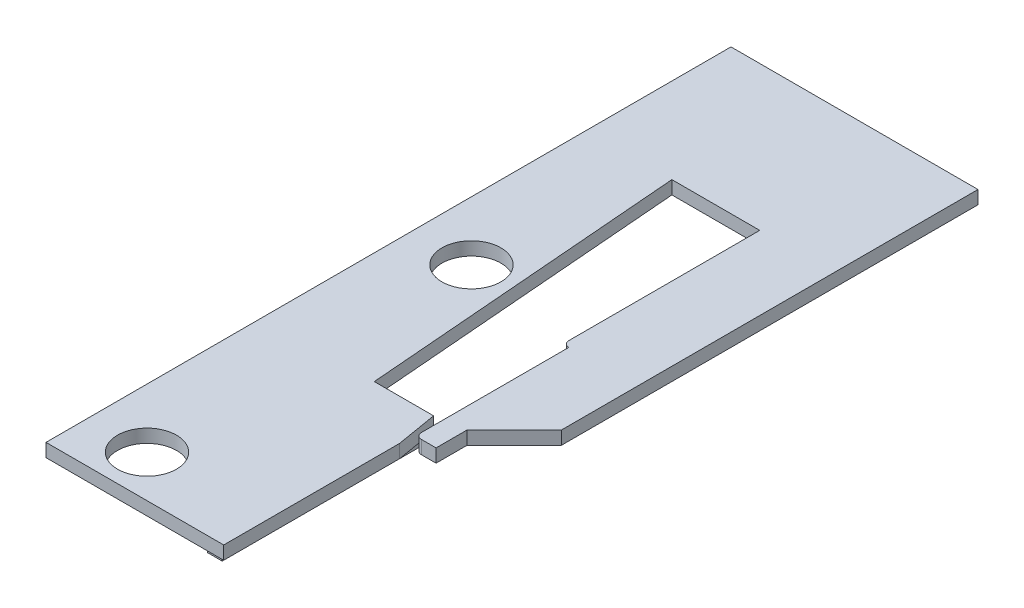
ISO-10303-21;
HEADER;
FILE_DESCRIPTION(('STEP AP214'),'2;1');
FILE_NAME('part.step','',(''),(''),'','','');
FILE_SCHEMA(('AUTOMOTIVE_DESIGN { 1 0 10303 214 1 1 1 1 }'));
ENDSEC;
DATA;
#1=APPLICATION_CONTEXT('core data for automotive mechanical design processes');
#2=APPLICATION_PROTOCOL_DEFINITION('international standard','automotive_design',2000,#1);
#3=PRODUCT_CONTEXT('',#1,'mechanical');
#4=PRODUCT('Part','Part','',(#3));
#5=PRODUCT_RELATED_PRODUCT_CATEGORY('part','',(#4));
#6=PRODUCT_DEFINITION_FORMATION('','',#4);
#7=PRODUCT_DEFINITION_CONTEXT('part definition',#1,'design');
#8=PRODUCT_DEFINITION('design','',#6,#7);
#9=PRODUCT_DEFINITION_SHAPE('','',#8);
#10=(LENGTH_UNIT() NAMED_UNIT(*) SI_UNIT(.MILLI.,.METRE.));
#11=(NAMED_UNIT(*) PLANE_ANGLE_UNIT() SI_UNIT($,.RADIAN.));
#12=(NAMED_UNIT(*) SI_UNIT($,.STERADIAN.) SOLID_ANGLE_UNIT());
#13=UNCERTAINTY_MEASURE_WITH_UNIT(LENGTH_MEASURE(1.E-05),#10,'distance_accuracy_value','');
#14=(GEOMETRIC_REPRESENTATION_CONTEXT(3) GLOBAL_UNCERTAINTY_ASSIGNED_CONTEXT((#13)) GLOBAL_UNIT_ASSIGNED_CONTEXT((#10,
#11,#12)) REPRESENTATION_CONTEXT('',''));
#15=CARTESIAN_POINT('',(0.,0.,0.));
#16=DIRECTION('',(0.,0.,1.));
#17=DIRECTION('',(1.,0.,0.));
#18=AXIS2_PLACEMENT_3D('',#15,#16,#17);
#19=CARTESIAN_POINT('',(42.25,0.9,0.));
#20=DIRECTION('',(1.,0.,0.));
#21=DIRECTION('',(0.,0.,-1.));
#22=AXIS2_PLACEMENT_3D('',#19,#20,#21);
#23=PLANE('',#22);
#24=DIRECTION('',(0.,-1.,0.));
#25=VECTOR('',#24,1.);
#26=CARTESIAN_POINT('',(42.25,0.9,-9.5));
#27=LINE('',#26,#25);
#28=CARTESIAN_POINT('',(42.25,0.9,-9.5));
#29=VERTEX_POINT('',#28);
#30=CARTESIAN_POINT('',(42.25,0.,-9.5));
#31=VERTEX_POINT('',#30);
#32=EDGE_CURVE('E276',#29,#31,#27,.T.);
#33=ORIENTED_EDGE('',*,*,#32,.T.);
#34=DIRECTION('',(0.,0.,1.));
#35=VECTOR('',#34,1.);
#36=CARTESIAN_POINT('',(42.25,0.,-13.5000000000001));
#37=LINE('',#36,#35);
#38=CARTESIAN_POINT('',(42.25,0.,-13.5000000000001));
#39=VERTEX_POINT('',#38);
#40=EDGE_CURVE('E253',#39,#31,#37,.T.);
#41=ORIENTED_EDGE('',*,*,#40,.F.);
#42=DIRECTION('',(0.,1.,0.));
#43=VECTOR('',#42,1.);
#44=CARTESIAN_POINT('',(42.25,-0.4,-13.5000000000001));
#45=LINE('',#44,#43);
#46=CARTESIAN_POINT('',(42.25,-0.4,-13.5000000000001));
#47=VERTEX_POINT('',#46);
#48=EDGE_CURVE('E261',#47,#39,#45,.T.);
#49=ORIENTED_EDGE('',*,*,#48,.F.);
#50=DIRECTION('',(0.,0.,1.));
#51=VECTOR('',#50,1.);
#52=CARTESIAN_POINT('',(42.25,-0.4,-13.5000000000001));
#53=LINE('',#52,#51);
#54=CARTESIAN_POINT('',(42.25,-0.4,0.499999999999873));
#55=VERTEX_POINT('',#54);
#56=EDGE_CURVE('E242',#47,#55,#53,.T.);
#57=ORIENTED_EDGE('',*,*,#56,.T.);
#58=DIRECTION('',(0.,1.,0.));
#59=VECTOR('',#58,1.);
#60=CARTESIAN_POINT('',(42.25,-0.4,0.499999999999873));
#61=LINE('',#60,#59);
#62=CARTESIAN_POINT('',(42.25,0.,0.499999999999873));
#63=VERTEX_POINT('',#62);
#64=EDGE_CURVE('E259',#55,#63,#61,.T.);
#65=ORIENTED_EDGE('',*,*,#64,.T.);
#66=DIRECTION('',(0.,-1.,0.));
#67=VECTOR('',#66,1.);
#68=CARTESIAN_POINT('',(42.25,0.9,0.500000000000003));
#69=LINE('',#68,#67);
#70=CARTESIAN_POINT('',(42.25,0.9,0.500000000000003));
#71=VERTEX_POINT('',#70);
#72=EDGE_CURVE('E11',#71,#63,#69,.T.);
#73=ORIENTED_EDGE('',*,*,#72,.F.);
#74=DIRECTION('',(0.,0.,1.));
#75=VECTOR('',#74,1.);
#76=CARTESIAN_POINT('',(42.25,0.9,0.));
#77=LINE('',#76,#75);
#78=EDGE_CURVE('E434',#29,#71,#77,.T.);
#79=ORIENTED_EDGE('',*,*,#78,.F.);
#80=EDGE_LOOP('',(#33,#41,#49,#57,#65,#73,#79));
#81=FACE_BOUND('',#80,.T.);
#82=ADVANCED_FACE('F35',(#81),#23,.F.);
#83=CARTESIAN_POINT('',(42.65,0.9,0.5));
#84=DIRECTION('',(0.,-1.,0.));
#85=DIRECTION('',(0.,0.,-1.));
#86=AXIS2_PLACEMENT_3D('',#83,#84,#85);
#87=CYLINDRICAL_SURFACE('',#86,0.399999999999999);
#88=CARTESIAN_POINT('',(42.65,0.,0.5));
#89=DIRECTION('',(0.,1.,0.));
#90=DIRECTION('',(0.,0.,1.));
#91=AXIS2_PLACEMENT_3D('',#88,#89,#90);
#92=CIRCLE('',#91,0.399999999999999);
#93=CARTESIAN_POINT('',(42.65,0.,0.9));
#94=VERTEX_POINT('',#93);
#95=EDGE_CURVE('E302',#63,#94,#92,.T.);
#96=ORIENTED_EDGE('',*,*,#95,.T.);
#97=DIRECTION('',(0.,-1.,0.));
#98=VECTOR('',#97,1.);
#99=CARTESIAN_POINT('',(42.65,0.9,0.9));
#100=LINE('',#99,#98);
#101=CARTESIAN_POINT('',(42.65,0.9,0.9));
#102=VERTEX_POINT('',#101);
#103=EDGE_CURVE('E44',#102,#94,#100,.T.);
#104=ORIENTED_EDGE('',*,*,#103,.F.);
#105=CARTESIAN_POINT('',(42.65,0.9,0.5));
#106=DIRECTION('',(0.,1.,0.));
#107=DIRECTION('',(0.,0.,1.));
#108=AXIS2_PLACEMENT_3D('',#105,#106,#107);
#109=CIRCLE('',#108,0.399999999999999);
#110=EDGE_CURVE('E393',#71,#102,#109,.T.);
#111=ORIENTED_EDGE('',*,*,#110,.F.);
#112=ORIENTED_EDGE('',*,*,#72,.T.);
#113=EDGE_LOOP('',(#96,#104,#111,#112));
#114=FACE_BOUND('',#113,.T.);
#115=ADVANCED_FACE('F457',(#114),#87,.T.);
#116=CARTESIAN_POINT('',(0.,0.9,0.900000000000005));
#117=DIRECTION('',(0.,0.,-1.));
#118=DIRECTION('',(-1.,0.,0.));
#119=AXIS2_PLACEMENT_3D('',#116,#117,#118);
#120=PLANE('',#119);
#121=DIRECTION('',(1.,0.,0.));
#122=VECTOR('',#121,1.);
#123=CARTESIAN_POINT('',(0.,0.,0.900000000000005));
#124=LINE('',#123,#122);
#125=CARTESIAN_POINT('',(43.65,0.,0.9));
#126=VERTEX_POINT('',#125);
#127=EDGE_CURVE('E304',#94,#126,#124,.T.);
#128=ORIENTED_EDGE('',*,*,#127,.T.);
#129=DIRECTION('',(0.,-1.,0.));
#130=VECTOR('',#129,1.);
#131=CARTESIAN_POINT('',(43.65,0.9,0.9));
#132=LINE('',#131,#130);
#133=CARTESIAN_POINT('',(43.65,0.9,0.9));
#134=VERTEX_POINT('',#133);
#135=EDGE_CURVE('E365',#134,#126,#132,.T.);
#136=ORIENTED_EDGE('',*,*,#135,.F.);
#137=DIRECTION('',(1.,0.,0.));
#138=VECTOR('',#137,1.);
#139=CARTESIAN_POINT('',(0.,0.9,0.900000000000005));
#140=LINE('',#139,#138);
#141=EDGE_CURVE('E373',#102,#134,#140,.T.);
#142=ORIENTED_EDGE('',*,*,#141,.F.);
#143=ORIENTED_EDGE('',*,*,#103,.T.);
#144=EDGE_LOOP('',(#128,#136,#142,#143));
#145=FACE_BOUND('',#144,.T.);
#146=ADVANCED_FACE('F371',(#145),#120,.F.);
#147=CARTESIAN_POINT('',(43.65,0.9,0.));
#148=DIRECTION('',(1.,0.,0.));
#149=DIRECTION('',(0.,0.,-1.));
#150=AXIS2_PLACEMENT_3D('',#147,#148,#149);
#151=PLANE('',#150);
#152=DIRECTION('',(0.,0.,1.));
#153=VECTOR('',#152,1.);
#154=CARTESIAN_POINT('',(43.65,0.,0.));
#155=LINE('',#154,#153);
#156=CARTESIAN_POINT('',(43.65,0.,-1.20000000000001));
#157=VERTEX_POINT('',#156);
#158=EDGE_CURVE('E307',#157,#126,#155,.T.);
#159=ORIENTED_EDGE('',*,*,#158,.F.);
#160=DIRECTION('',(0.,-1.,0.));
#161=VECTOR('',#160,1.);
#162=CARTESIAN_POINT('',(43.65,0.9,-1.20000000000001));
#163=LINE('',#162,#161);
#164=CARTESIAN_POINT('',(43.65,0.9,-1.20000000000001));
#165=VERTEX_POINT('',#164);
#166=EDGE_CURVE('E363',#165,#157,#163,.T.);
#167=ORIENTED_EDGE('',*,*,#166,.F.);
#168=DIRECTION('',(0.,0.,1.));
#169=VECTOR('',#168,1.);
#170=CARTESIAN_POINT('',(43.65,0.9,0.));
#171=LINE('',#170,#169);
#172=EDGE_CURVE('E386',#165,#134,#171,.T.);
#173=ORIENTED_EDGE('',*,*,#172,.T.);
#174=ORIENTED_EDGE('',*,*,#135,.T.);
#175=EDGE_LOOP('',(#159,#167,#173,#174));
#176=FACE_BOUND('',#175,.T.);
#177=ADVANCED_FACE('F383',(#176),#151,.T.);
#178=CARTESIAN_POINT('',(21.225,0.9,21.225));
#179=DIRECTION('',(0.707106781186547,0.,0.707106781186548));
#180=DIRECTION('',(0.707106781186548,0.,-0.707106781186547));
#181=AXIS2_PLACEMENT_3D('',#178,#179,#180);
#182=PLANE('',#181);
#183=DIRECTION('',(-0.707106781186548,0.,0.707106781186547));
#184=VECTOR('',#183,1.);
#185=CARTESIAN_POINT('',(21.225,0.,21.225));
#186=LINE('',#185,#184);
#187=CARTESIAN_POINT('',(46.85,0.,-4.40000000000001));
#188=VERTEX_POINT('',#187);
#189=EDGE_CURVE('E310',#188,#157,#186,.T.);
#190=ORIENTED_EDGE('',*,*,#189,.F.);
#191=DIRECTION('',(0.,-1.,0.));
#192=VECTOR('',#191,1.);
#193=CARTESIAN_POINT('',(46.85,0.9,-4.40000000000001));
#194=LINE('',#193,#192);
#195=CARTESIAN_POINT('',(46.85,0.9,-4.40000000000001));
#196=VERTEX_POINT('',#195);
#197=EDGE_CURVE('E361',#196,#188,#194,.T.);
#198=ORIENTED_EDGE('',*,*,#197,.F.);
#199=DIRECTION('',(-0.707106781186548,0.,0.707106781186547));
#200=VECTOR('',#199,1.);
#201=CARTESIAN_POINT('',(21.225,0.9,21.225));
#202=LINE('',#201,#200);
#203=EDGE_CURVE('E389',#196,#165,#202,.T.);
#204=ORIENTED_EDGE('',*,*,#203,.T.);
#205=ORIENTED_EDGE('',*,*,#166,.T.);
#206=EDGE_LOOP('',(#190,#198,#204,#205));
#207=FACE_BOUND('',#206,.T.);
#208=ADVANCED_FACE('F510',(#207),#182,.T.);
#209=CARTESIAN_POINT('',(46.85,0.9,0.));
#210=DIRECTION('',(-1.,0.,0.));
#211=DIRECTION('',(0.,0.,1.));
#212=AXIS2_PLACEMENT_3D('',#209,#210,#211);
#213=PLANE('',#212);
#214=DIRECTION('',(0.,0.,-1.));
#215=VECTOR('',#214,1.);
#216=CARTESIAN_POINT('',(46.85,0.,0.));
#217=LINE('',#216,#215);
#218=CARTESIAN_POINT('',(46.85,0.,-32.65));
#219=VERTEX_POINT('',#218);
#220=EDGE_CURVE('E313',#188,#219,#217,.T.);
#221=ORIENTED_EDGE('',*,*,#220,.T.);
#222=DIRECTION('',(0.,-1.,0.));
#223=VECTOR('',#222,1.);
#224=CARTESIAN_POINT('',(46.85,0.9,-32.65));
#225=LINE('',#224,#223);
#226=CARTESIAN_POINT('',(46.85,0.9,-32.65));
#227=VERTEX_POINT('',#226);
#228=EDGE_CURVE('E359',#227,#219,#225,.T.);
#229=ORIENTED_EDGE('',*,*,#228,.F.);
#230=DIRECTION('',(0.,0.,-1.));
#231=VECTOR('',#230,1.);
#232=CARTESIAN_POINT('',(46.85,0.9,0.));
#233=LINE('',#232,#231);
#234=EDGE_CURVE('E391',#196,#227,#233,.T.);
#235=ORIENTED_EDGE('',*,*,#234,.F.);
#236=ORIENTED_EDGE('',*,*,#197,.T.);
#237=EDGE_LOOP('',(#221,#229,#235,#236));
#238=FACE_BOUND('',#237,.T.);
#239=ADVANCED_FACE('F506',(#238),#213,.F.);
#240=CARTESIAN_POINT('',(0.,0.9,-32.65));
#241=DIRECTION('',(0.,0.,-1.));
#242=DIRECTION('',(-1.,0.,0.));
#243=AXIS2_PLACEMENT_3D('',#240,#241,#242);
#244=PLANE('',#243);
#245=DIRECTION('',(1.,0.,0.));
#246=VECTOR('',#245,1.);
#247=CARTESIAN_POINT('',(0.,0.,-32.65));
#248=LINE('',#247,#246);
#249=CARTESIAN_POINT('',(30.1,0.,-32.65));
#250=VERTEX_POINT('',#249);
#251=EDGE_CURVE('E316',#250,#219,#248,.T.);
#252=ORIENTED_EDGE('',*,*,#251,.F.);
#253=DIRECTION('',(0.,-1.,0.));
#254=VECTOR('',#253,1.);
#255=CARTESIAN_POINT('',(30.1,0.9,-32.65));
#256=LINE('',#255,#254);
#257=CARTESIAN_POINT('',(30.1,0.9,-32.65));
#258=VERTEX_POINT('',#257);
#259=EDGE_CURVE('E357',#258,#250,#256,.T.);
#260=ORIENTED_EDGE('',*,*,#259,.F.);
#261=DIRECTION('',(1.,0.,0.));
#262=VECTOR('',#261,1.);
#263=CARTESIAN_POINT('',(0.,0.9,-32.65));
#264=LINE('',#263,#262);
#265=EDGE_CURVE('E398',#258,#227,#264,.T.);
#266=ORIENTED_EDGE('',*,*,#265,.T.);
#267=ORIENTED_EDGE('',*,*,#228,.T.);
#268=EDGE_LOOP('',(#252,#260,#266,#267));
#269=FACE_BOUND('',#268,.T.);
#270=ADVANCED_FACE('F502',(#269),#244,.T.);
#271=CARTESIAN_POINT('',(30.1,0.9,0.));
#272=DIRECTION('',(-1.,0.,0.));
#273=DIRECTION('',(0.,0.,1.));
#274=AXIS2_PLACEMENT_3D('',#271,#272,#273);
#275=PLANE('',#274);
#276=DIRECTION('',(0.,0.,-1.));
#277=VECTOR('',#276,1.);
#278=CARTESIAN_POINT('',(30.1,0.,0.));
#279=LINE('',#278,#277);
#280=CARTESIAN_POINT('',(30.1,0.,13.8));
#281=VERTEX_POINT('',#280);
#282=EDGE_CURVE('E319',#281,#250,#279,.T.);
#283=ORIENTED_EDGE('',*,*,#282,.F.);
#284=DIRECTION('',(0.,-1.,0.));
#285=VECTOR('',#284,1.);
#286=CARTESIAN_POINT('',(30.1,0.9,13.8));
#287=LINE('',#286,#285);
#288=CARTESIAN_POINT('',(30.1,0.9,13.8));
#289=VERTEX_POINT('',#288);
#290=EDGE_CURVE('E355',#289,#281,#287,.T.);
#291=ORIENTED_EDGE('',*,*,#290,.F.);
#292=DIRECTION('',(0.,0.,-1.));
#293=VECTOR('',#292,1.);
#294=CARTESIAN_POINT('',(30.1,0.9,0.));
#295=LINE('',#294,#293);
#296=EDGE_CURVE('E401',#289,#258,#295,.T.);
#297=ORIENTED_EDGE('',*,*,#296,.T.);
#298=ORIENTED_EDGE('',*,*,#259,.T.);
#299=EDGE_LOOP('',(#283,#291,#297,#298));
#300=FACE_BOUND('',#299,.T.);
#301=ADVANCED_FACE('F498',(#300),#275,.T.);
#302=CARTESIAN_POINT('',(0.,0.9,13.8));
#303=DIRECTION('',(0.,0.,1.));
#304=DIRECTION('',(1.,0.,0.));
#305=AXIS2_PLACEMENT_3D('',#302,#303,#304);
#306=PLANE('',#305);
#307=DIRECTION('',(-1.,0.,0.));
#308=VECTOR('',#307,1.);
#309=CARTESIAN_POINT('',(0.,0.,13.8));
#310=LINE('',#309,#308);
#311=CARTESIAN_POINT('',(42.15,0.,13.8));
#312=VERTEX_POINT('',#311);
#313=EDGE_CURVE('E322',#312,#281,#310,.T.);
#314=ORIENTED_EDGE('',*,*,#313,.F.);
#315=DIRECTION('',(0.,-1.,0.));
#316=VECTOR('',#315,1.);
#317=CARTESIAN_POINT('',(42.15,0.9,13.8));
#318=LINE('',#317,#316);
#319=CARTESIAN_POINT('',(42.15,0.9,13.8));
#320=VERTEX_POINT('',#319);
#321=EDGE_CURVE('E353',#320,#312,#318,.T.);
#322=ORIENTED_EDGE('',*,*,#321,.F.);
#323=DIRECTION('',(-1.,0.,0.));
#324=VECTOR('',#323,1.);
#325=CARTESIAN_POINT('',(0.,0.9,13.8));
#326=LINE('',#325,#324);
#327=EDGE_CURVE('E404',#320,#289,#326,.T.);
#328=ORIENTED_EDGE('',*,*,#327,.T.);
#329=ORIENTED_EDGE('',*,*,#290,.T.);
#330=EDGE_LOOP('',(#314,#322,#328,#329));
#331=FACE_BOUND('',#330,.T.);
#332=ADVANCED_FACE('F494',(#331),#306,.T.);
#333=CARTESIAN_POINT('',(42.15,0.9,0.));
#334=DIRECTION('',(1.,0.,0.));
#335=DIRECTION('',(0.,0.,-1.));
#336=AXIS2_PLACEMENT_3D('',#333,#334,#335);
#337=PLANE('',#336);
#338=DIRECTION('',(0.,0.,1.));
#339=VECTOR('',#338,1.);
#340=CARTESIAN_POINT('',(42.15,0.,0.));
#341=LINE('',#340,#339);
#342=CARTESIAN_POINT('',(42.15,0.,1.8733333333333));
#343=VERTEX_POINT('',#342);
#344=EDGE_CURVE('E325',#343,#312,#341,.T.);
#345=ORIENTED_EDGE('',*,*,#344,.F.);
#346=DIRECTION('',(0.,-1.,0.));
#347=VECTOR('',#346,1.);
#348=CARTESIAN_POINT('',(42.15,0.9,1.8733333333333));
#349=LINE('',#348,#347);
#350=CARTESIAN_POINT('',(42.15,0.9,1.8733333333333));
#351=VERTEX_POINT('',#350);
#352=EDGE_CURVE('E350',#351,#343,#349,.T.);
#353=ORIENTED_EDGE('',*,*,#352,.F.);
#354=DIRECTION('',(0.,0.,1.));
#355=VECTOR('',#354,1.);
#356=CARTESIAN_POINT('',(42.15,0.9,0.));
#357=LINE('',#356,#355);
#358=EDGE_CURVE('E407',#351,#320,#357,.T.);
#359=ORIENTED_EDGE('',*,*,#358,.T.);
#360=ORIENTED_EDGE('',*,*,#321,.T.);
#361=EDGE_LOOP('',(#345,#353,#359,#360));
#362=FACE_BOUND('',#361,.T.);
#363=ADVANCED_FACE('F490',(#362),#337,.T.);
#364=CARTESIAN_POINT('',(40.6787687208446,0.9,-6.85597225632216));
#365=DIRECTION('',(0.986092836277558,0.,-0.166195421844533));
#366=DIRECTION('',(-0.166195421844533,0.,-0.986092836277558));
#367=AXIS2_PLACEMENT_3D('',#364,#365,#366);
#368=PLANE('',#367);
#369=DIRECTION('',(0.166195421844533,0.,0.986092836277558));
#370=VECTOR('',#369,1.);
#371=CARTESIAN_POINT('',(40.6787687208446,0.,-6.85597225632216));
#372=LINE('',#371,#370);
#373=CARTESIAN_POINT('',(41.6825842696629,0.,-0.900000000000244));
#374=VERTEX_POINT('',#373);
#375=CARTESIAN_POINT('',(41.75,0.,-0.500000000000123));
#376=VERTEX_POINT('',#375);
#377=EDGE_CURVE('E329',#374,#376,#372,.T.);
#378=ORIENTED_EDGE('',*,*,#377,.F.);
#379=DIRECTION('',(0.,-1.,0.));
#380=VECTOR('',#379,1.);
#381=CARTESIAN_POINT('',(41.6825842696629,0.9,-0.900000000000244));
#382=LINE('',#381,#380);
#383=CARTESIAN_POINT('',(41.6825842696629,0.9,-0.900000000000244));
#384=VERTEX_POINT('',#383);
#385=EDGE_CURVE('E348',#384,#374,#382,.T.);
#386=ORIENTED_EDGE('',*,*,#385,.F.);
#387=DIRECTION('',(0.166195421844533,0.,0.986092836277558));
#388=VECTOR('',#387,1.);
#389=CARTESIAN_POINT('',(40.6787687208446,0.9,-6.85597225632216));
#390=LINE('',#389,#388);
#391=EDGE_CURVE('E410',#384,#351,#390,.T.);
#392=ORIENTED_EDGE('',*,*,#391,.T.);
#393=ORIENTED_EDGE('',*,*,#352,.T.);
#394=EDGE_CURVE('E328',#376,#343,#372,.T.);
#395=ORIENTED_EDGE('',*,*,#394,.F.);
#396=EDGE_LOOP('',(#378,#386,#392,#393,#395));
#397=FACE_BOUND('',#396,.T.);
#398=ADVANCED_FACE('F486',(#397),#368,.T.);
#399=CARTESIAN_POINT('',(0.,0.9,-0.900000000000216));
#400=DIRECTION('',(0.,0.,-1.));
#401=DIRECTION('',(-1.,0.,0.));
#402=AXIS2_PLACEMENT_3D('',#399,#400,#401);
#403=PLANE('',#402);
#404=DIRECTION('',(1.,0.,0.));
#405=VECTOR('',#404,1.);
#406=CARTESIAN_POINT('',(0.,0.,-0.900000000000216));
#407=LINE('',#406,#405);
#408=CARTESIAN_POINT('',(37.6614908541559,0.,-0.900000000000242));
#409=VERTEX_POINT('',#408);
#410=EDGE_CURVE('E332',#409,#374,#407,.T.);
#411=ORIENTED_EDGE('',*,*,#410,.F.);
#412=DIRECTION('',(0.,-1.,0.));
#413=VECTOR('',#412,1.);
#414=CARTESIAN_POINT('',(37.6614908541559,0.9,-0.900000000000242));
#415=LINE('',#414,#413);
#416=CARTESIAN_POINT('',(37.6614908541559,0.9,-0.900000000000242));
#417=VERTEX_POINT('',#416);
#418=EDGE_CURVE('E346',#417,#409,#415,.T.);
#419=ORIENTED_EDGE('',*,*,#418,.F.);
#420=DIRECTION('',(1.,0.,0.));
#421=VECTOR('',#420,1.);
#422=CARTESIAN_POINT('',(0.,0.9,-0.900000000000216));
#423=LINE('',#422,#421);
#424=EDGE_CURVE('E413',#417,#384,#423,.T.);
#425=ORIENTED_EDGE('',*,*,#424,.T.);
#426=ORIENTED_EDGE('',*,*,#385,.T.);
#427=EDGE_LOOP('',(#411,#419,#425,#426));
#428=FACE_BOUND('',#427,.T.);
#429=ADVANCED_FACE('F482',(#428),#403,.T.);
#430=CARTESIAN_POINT('',(37.4903141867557,0.9,-3.02292966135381));
#431=DIRECTION('',(0.996764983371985,0.,-0.080371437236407));
#432=DIRECTION('',(-0.080371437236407,0.,-0.996764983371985));
#433=AXIS2_PLACEMENT_3D('',#430,#431,#432);
#434=PLANE('',#433);
#435=DIRECTION('',(0.080371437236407,0.,0.996764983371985));
#436=VECTOR('',#435,1.);
#437=CARTESIAN_POINT('',(37.4903141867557,0.,-3.02292966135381));
#438=LINE('',#437,#436);
#439=CARTESIAN_POINT('',(35.8916122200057,0.,-22.85));
#440=VERTEX_POINT('',#439);
#441=EDGE_CURVE('E335',#440,#409,#438,.T.);
#442=ORIENTED_EDGE('',*,*,#441,.F.);
#443=DIRECTION('',(0.,-1.,0.));
#444=VECTOR('',#443,1.);
#445=CARTESIAN_POINT('',(35.8916122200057,0.9,-22.85));
#446=LINE('',#445,#444);
#447=CARTESIAN_POINT('',(35.8916122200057,0.9,-22.85));
#448=VERTEX_POINT('',#447);
#449=EDGE_CURVE('E344',#448,#440,#446,.T.);
#450=ORIENTED_EDGE('',*,*,#449,.F.);
#451=DIRECTION('',(0.080371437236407,0.,0.996764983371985));
#452=VECTOR('',#451,1.);
#453=CARTESIAN_POINT('',(37.4903141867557,0.9,-3.02292966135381));
#454=LINE('',#453,#452);
#455=EDGE_CURVE('E416',#448,#417,#454,.T.);
#456=ORIENTED_EDGE('',*,*,#455,.T.);
#457=ORIENTED_EDGE('',*,*,#418,.T.);
#458=EDGE_LOOP('',(#442,#450,#456,#457));
#459=FACE_BOUND('',#458,.T.);
#460=ADVANCED_FACE('F477',(#459),#434,.T.);
#461=CARTESIAN_POINT('',(0.,0.9,-22.85));
#462=DIRECTION('',(0.,0.,1.));
#463=DIRECTION('',(1.,0.,0.));
#464=AXIS2_PLACEMENT_3D('',#461,#462,#463);
#465=PLANE('',#464);
#466=DIRECTION('',(-1.,0.,0.));
#467=VECTOR('',#466,1.);
#468=CARTESIAN_POINT('',(0.,0.,-22.85));
#469=LINE('',#468,#467);
#470=CARTESIAN_POINT('',(41.85,0.,-22.85));
#471=VERTEX_POINT('',#470);
#472=EDGE_CURVE('E338',#471,#440,#469,.T.);
#473=ORIENTED_EDGE('',*,*,#472,.F.);
#474=DIRECTION('',(0.,-1.,0.));
#475=VECTOR('',#474,1.);
#476=CARTESIAN_POINT('',(41.85,0.9,-22.85));
#477=LINE('',#476,#475);
#478=CARTESIAN_POINT('',(41.85,0.9,-22.85));
#479=VERTEX_POINT('',#478);
#480=EDGE_CURVE('E284',#479,#471,#477,.T.);
#481=ORIENTED_EDGE('',*,*,#480,.F.);
#482=DIRECTION('',(-1.,0.,0.));
#483=VECTOR('',#482,1.);
#484=CARTESIAN_POINT('',(0.,0.9,-22.85));
#485=LINE('',#484,#483);
#486=EDGE_CURVE('E293',#479,#448,#485,.T.);
#487=ORIENTED_EDGE('',*,*,#486,.T.);
#488=ORIENTED_EDGE('',*,*,#449,.T.);
#489=EDGE_LOOP('',(#473,#481,#487,#488));
#490=FACE_BOUND('',#489,.T.);
#491=ADVANCED_FACE('F422',(#490),#465,.T.);
#492=CARTESIAN_POINT('',(41.85,0.9,0.));
#493=DIRECTION('',(-1.,0.,0.));
#494=DIRECTION('',(0.,0.,1.));
#495=AXIS2_PLACEMENT_3D('',#492,#493,#494);
#496=PLANE('',#495);
#497=DIRECTION('',(0.,0.,-1.));
#498=VECTOR('',#497,1.);
#499=CARTESIAN_POINT('',(41.85,0.,0.));
#500=LINE('',#499,#498);
#501=CARTESIAN_POINT('',(41.85,0.,-9.9));
#502=VERTEX_POINT('',#501);
#503=EDGE_CURVE('E274',#502,#471,#500,.T.);
#504=ORIENTED_EDGE('',*,*,#503,.F.);
#505=DIRECTION('',(0.,-1.,0.));
#506=VECTOR('',#505,1.);
#507=CARTESIAN_POINT('',(41.85,0.9,-9.9));
#508=LINE('',#507,#506);
#509=CARTESIAN_POINT('',(41.85,0.9,-9.9));
#510=VERTEX_POINT('',#509);
#511=EDGE_CURVE('E278',#510,#502,#508,.T.);
#512=ORIENTED_EDGE('',*,*,#511,.F.);
#513=DIRECTION('',(0.,0.,-1.));
#514=VECTOR('',#513,1.);
#515=CARTESIAN_POINT('',(41.85,0.9,0.));
#516=LINE('',#515,#514);
#517=EDGE_CURVE('E286',#510,#479,#516,.T.);
#518=ORIENTED_EDGE('',*,*,#517,.T.);
#519=ORIENTED_EDGE('',*,*,#480,.T.);
#520=EDGE_LOOP('',(#504,#512,#518,#519));
#521=FACE_BOUND('',#520,.T.);
#522=ADVANCED_FACE('F429',(#521),#496,.T.);
#523=CARTESIAN_POINT('',(34.1,0.9,-11.05));
#524=DIRECTION('',(0.,-1.,0.));
#525=DIRECTION('',(0.,0.,-1.));
#526=AXIS2_PLACEMENT_3D('',#523,#524,#525);
#527=CYLINDRICAL_SURFACE('',#526,2.);
#528=CARTESIAN_POINT('',(34.1,0.9,-11.05));
#529=DIRECTION('',(0.,1.,0.));
#530=DIRECTION('',(0.,0.,1.));
#531=AXIS2_PLACEMENT_3D('',#528,#529,#530);
#532=CIRCLE('',#531,2.);
#533=CARTESIAN_POINT('',(34.1,0.9,-9.05));
#534=VERTEX_POINT('',#533);
#535=EDGE_CURVE('E435',#534,#534,#532,.T.);
#536=ORIENTED_EDGE('',*,*,#535,.T.);
#537=EDGE_LOOP('',(#536));
#538=FACE_BOUND('',#537,.T.);
#539=CARTESIAN_POINT('',(34.1,0.,-11.05));
#540=DIRECTION('',(0.,1.,0.));
#541=DIRECTION('',(0.,0.,1.));
#542=AXIS2_PLACEMENT_3D('',#539,#540,#541);
#543=CIRCLE('',#542,2.);
#544=CARTESIAN_POINT('',(34.1,0.,-9.05));
#545=VERTEX_POINT('',#544);
#546=EDGE_CURVE('E299',#545,#545,#543,.T.);
#547=ORIENTED_EDGE('',*,*,#546,.F.);
#548=EDGE_LOOP('',(#547));
#549=FACE_BOUND('',#548,.T.);
#550=ADVANCED_FACE('F464',(#538,#549),#527,.F.);
#551=CARTESIAN_POINT('',(34.1,0.9,10.95));
#552=DIRECTION('',(0.,-1.,0.));
#553=DIRECTION('',(0.,0.,-1.));
#554=AXIS2_PLACEMENT_3D('',#551,#552,#553);
#555=CYLINDRICAL_SURFACE('',#554,2.);
#556=CARTESIAN_POINT('',(34.1,0.9,10.95));
#557=DIRECTION('',(0.,1.,0.));
#558=DIRECTION('',(0.,0.,1.));
#559=AXIS2_PLACEMENT_3D('',#556,#557,#558);
#560=CIRCLE('',#559,2.);
#561=CARTESIAN_POINT('',(34.1,0.9,12.95));
#562=VERTEX_POINT('',#561);
#563=EDGE_CURVE('E266',#562,#562,#560,.T.);
#564=ORIENTED_EDGE('',*,*,#563,.T.);
#565=EDGE_LOOP('',(#564));
#566=FACE_BOUND('',#565,.T.);
#567=CARTESIAN_POINT('',(34.1,0.,10.95));
#568=DIRECTION('',(0.,1.,0.));
#569=DIRECTION('',(0.,0.,1.));
#570=AXIS2_PLACEMENT_3D('',#567,#568,#569);
#571=CIRCLE('',#570,2.);
#572=CARTESIAN_POINT('',(34.1,0.,12.95));
#573=VERTEX_POINT('',#572);
#574=EDGE_CURVE('E258',#573,#573,#571,.T.);
#575=ORIENTED_EDGE('',*,*,#574,.F.);
#576=EDGE_LOOP('',(#575));
#577=FACE_BOUND('',#576,.T.);
#578=ADVANCED_FACE('F37',(#566,#577),#555,.F.);
#579=CARTESIAN_POINT('',(42.25,0.9,-9.89999999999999));
#580=DIRECTION('',(0.,-1.,0.));
#581=DIRECTION('',(0.,0.,-1.));
#582=AXIS2_PLACEMENT_3D('',#579,#580,#581);
#583=CYLINDRICAL_SURFACE('',#582,0.399999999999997);
#584=CARTESIAN_POINT('',(42.25,0.,-9.89999999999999));
#585=DIRECTION('',(0.,1.,0.));
#586=DIRECTION('',(0.,0.,1.));
#587=AXIS2_PLACEMENT_3D('',#584,#585,#586);
#588=CIRCLE('',#587,0.399999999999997);
#589=EDGE_CURVE('E271',#502,#31,#588,.T.);
#590=ORIENTED_EDGE('',*,*,#589,.T.);
#591=ORIENTED_EDGE('',*,*,#32,.F.);
#592=CARTESIAN_POINT('',(42.25,0.9,-9.89999999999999));
#593=DIRECTION('',(0.,1.,0.));
#594=DIRECTION('',(0.,0.,1.));
#595=AXIS2_PLACEMENT_3D('',#592,#593,#594);
#596=CIRCLE('',#595,0.399999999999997);
#597=EDGE_CURVE('E279',#510,#29,#596,.T.);
#598=ORIENTED_EDGE('',*,*,#597,.F.);
#599=ORIENTED_EDGE('',*,*,#511,.T.);
#600=EDGE_LOOP('',(#590,#591,#598,#599));
#601=FACE_BOUND('',#600,.T.);
#602=ADVANCED_FACE('F432',(#601),#583,.T.);
#603=CARTESIAN_POINT('',(0.,0.9,0.));
#604=DIRECTION('',(0.,1.,0.));
#605=DIRECTION('',(0.,0.,1.));
#606=AXIS2_PLACEMENT_3D('',#603,#604,#605);
#607=PLANE('',#606);
#608=ORIENTED_EDGE('',*,*,#563,.F.);
#609=EDGE_LOOP('',(#608));
#610=FACE_BOUND('',#609,.T.);
#611=ORIENTED_EDGE('',*,*,#535,.F.);
#612=EDGE_LOOP('',(#611));
#613=FACE_BOUND('',#612,.T.);
#614=ORIENTED_EDGE('',*,*,#78,.T.);
#615=ORIENTED_EDGE('',*,*,#110,.T.);
#616=ORIENTED_EDGE('',*,*,#141,.T.);
#617=ORIENTED_EDGE('',*,*,#172,.F.);
#618=ORIENTED_EDGE('',*,*,#203,.F.);
#619=ORIENTED_EDGE('',*,*,#234,.T.);
#620=ORIENTED_EDGE('',*,*,#265,.F.);
#621=ORIENTED_EDGE('',*,*,#296,.F.);
#622=ORIENTED_EDGE('',*,*,#327,.F.);
#623=ORIENTED_EDGE('',*,*,#358,.F.);
#624=ORIENTED_EDGE('',*,*,#391,.F.);
#625=ORIENTED_EDGE('',*,*,#424,.F.);
#626=ORIENTED_EDGE('',*,*,#455,.F.);
#627=ORIENTED_EDGE('',*,*,#486,.F.);
#628=ORIENTED_EDGE('',*,*,#517,.F.);
#629=ORIENTED_EDGE('',*,*,#597,.T.);
#630=EDGE_LOOP('',(#614,#615,#616,#617,#618,#619,#620,#621,#622,#623,#624,#625,#626,#627,#628,#629));
#631=FACE_BOUND('',#630,.T.);
#632=ADVANCED_FACE('F425',(#610,#613,#631),#607,.T.);
#633=CARTESIAN_POINT('',(0.,0.,0.));
#634=DIRECTION('',(0.,1.,0.));
#635=DIRECTION('',(0.,0.,1.));
#636=AXIS2_PLACEMENT_3D('',#633,#634,#635);
#637=PLANE('',#636);
#638=DIRECTION('',(-1.,0.,0.));
#639=VECTOR('',#638,1.);
#640=CARTESIAN_POINT('',(40.7499999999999,0.,-0.500000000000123));
#641=LINE('',#640,#639);
#642=CARTESIAN_POINT('',(40.7499999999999,0.,-0.500000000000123));
#643=VERTEX_POINT('',#642);
#644=EDGE_CURVE('E220',#376,#643,#641,.T.);
#645=ORIENTED_EDGE('',*,*,#644,.T.);
#646=DIRECTION('',(0.,0.,1.));
#647=VECTOR('',#646,1.);
#648=CARTESIAN_POINT('',(40.7499999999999,0.,-0.500000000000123));
#649=LINE('',#648,#647);
#650=CARTESIAN_POINT('',(40.7499999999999,0.,13.4999999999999));
#651=VERTEX_POINT('',#650);
#652=EDGE_CURVE('E227',#643,#651,#649,.T.);
#653=ORIENTED_EDGE('',*,*,#652,.T.);
#654=DIRECTION('',(1.,0.,0.));
#655=VECTOR('',#654,1.);
#656=CARTESIAN_POINT('',(40.7499999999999,0.,13.4999999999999));
#657=LINE('',#656,#655);
#658=CARTESIAN_POINT('',(41.75,0.,13.4999999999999));
#659=VERTEX_POINT('',#658);
#660=EDGE_CURVE('E200',#651,#659,#657,.T.);
#661=ORIENTED_EDGE('',*,*,#660,.T.);
#662=DIRECTION('',(0.,0.,-1.));
#663=VECTOR('',#662,1.);
#664=CARTESIAN_POINT('',(41.75,0.,-0.500000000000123));
#665=LINE('',#664,#663);
#666=EDGE_CURVE('E52',#659,#376,#665,.T.);
#667=ORIENTED_EDGE('',*,*,#666,.T.);
#668=ORIENTED_EDGE('',*,*,#394,.T.);
#669=ORIENTED_EDGE('',*,*,#344,.T.);
#670=ORIENTED_EDGE('',*,*,#313,.T.);
#671=ORIENTED_EDGE('',*,*,#282,.T.);
#672=ORIENTED_EDGE('',*,*,#251,.T.);
#673=ORIENTED_EDGE('',*,*,#220,.F.);
#674=ORIENTED_EDGE('',*,*,#189,.T.);
#675=ORIENTED_EDGE('',*,*,#158,.T.);
#676=ORIENTED_EDGE('',*,*,#127,.F.);
#677=ORIENTED_EDGE('',*,*,#95,.F.);
#678=DIRECTION('',(1.,0.,0.));
#679=VECTOR('',#678,1.);
#680=CARTESIAN_POINT('',(43.25,0.,0.499999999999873));
#681=LINE('',#680,#679);
#682=CARTESIAN_POINT('',(43.25,0.,0.499999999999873));
#683=VERTEX_POINT('',#682);
#684=EDGE_CURVE('E239',#63,#683,#681,.T.);
#685=ORIENTED_EDGE('',*,*,#684,.T.);
#686=DIRECTION('',(0.,0.,-1.));
#687=VECTOR('',#686,1.);
#688=CARTESIAN_POINT('',(43.25,0.,-13.5000000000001));
#689=LINE('',#688,#687);
#690=CARTESIAN_POINT('',(43.25,0.,-13.5000000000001));
#691=VERTEX_POINT('',#690);
#692=EDGE_CURVE('E60',#683,#691,#689,.T.);
#693=ORIENTED_EDGE('',*,*,#692,.T.);
#694=DIRECTION('',(-1.,0.,0.));
#695=VECTOR('',#694,1.);
#696=CARTESIAN_POINT('',(43.25,0.,-13.5000000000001));
#697=LINE('',#696,#695);
#698=EDGE_CURVE('E250',#691,#39,#697,.T.);
#699=ORIENTED_EDGE('',*,*,#698,.T.);
#700=ORIENTED_EDGE('',*,*,#40,.T.);
#701=ORIENTED_EDGE('',*,*,#589,.F.);
#702=ORIENTED_EDGE('',*,*,#503,.T.);
#703=ORIENTED_EDGE('',*,*,#472,.T.);
#704=ORIENTED_EDGE('',*,*,#441,.T.);
#705=ORIENTED_EDGE('',*,*,#410,.T.);
#706=ORIENTED_EDGE('',*,*,#377,.T.);
#707=EDGE_LOOP('',(#645,#653,#661,#667,#668,#669,#670,#671,#672,#673,#674,#675,#676,#677,#685,
#693,#699,#700,#701,#702,#703,#704,#705,#706));
#708=FACE_BOUND('',#707,.T.);
#709=ORIENTED_EDGE('',*,*,#574,.T.);
#710=EDGE_LOOP('',(#709));
#711=FACE_BOUND('',#710,.T.);
#712=ORIENTED_EDGE('',*,*,#546,.T.);
#713=EDGE_LOOP('',(#712));
#714=FACE_BOUND('',#713,.T.);
#715=ADVANCED_FACE('F377',(#708,#711,#714),#637,.F.);
#716=CARTESIAN_POINT('',(43.25,-0.4,-13.5000000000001));
#717=DIRECTION('',(1.,0.,0.));
#718=DIRECTION('',(0.,0.,-1.));
#719=AXIS2_PLACEMENT_3D('',#716,#717,#718);
#720=PLANE('',#719);
#721=ORIENTED_EDGE('',*,*,#692,.F.);
#722=DIRECTION('',(0.,1.,0.));
#723=VECTOR('',#722,1.);
#724=CARTESIAN_POINT('',(43.25,-0.4,0.499999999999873));
#725=LINE('',#724,#723);
#726=CARTESIAN_POINT('',(43.25,-0.4,0.499999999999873));
#727=VERTEX_POINT('',#726);
#728=EDGE_CURVE('E256',#727,#683,#725,.T.);
#729=ORIENTED_EDGE('',*,*,#728,.F.);
#730=DIRECTION('',(0.,0.,-1.));
#731=VECTOR('',#730,1.);
#732=CARTESIAN_POINT('',(43.25,-0.4,-13.5000000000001));
#733=LINE('',#732,#731);
#734=CARTESIAN_POINT('',(43.25,-0.4,-13.5000000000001));
#735=VERTEX_POINT('',#734);
#736=EDGE_CURVE('E235',#727,#735,#733,.T.);
#737=ORIENTED_EDGE('',*,*,#736,.T.);
#738=DIRECTION('',(0.,1.,0.));
#739=VECTOR('',#738,1.);
#740=CARTESIAN_POINT('',(43.25,-0.4,-13.5000000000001));
#741=LINE('',#740,#739);
#742=EDGE_CURVE('E248',#735,#691,#741,.T.);
#743=ORIENTED_EDGE('',*,*,#742,.T.);
#744=EDGE_LOOP('',(#721,#729,#737,#743));
#745=FACE_BOUND('',#744,.T.);
#746=ADVANCED_FACE('F452',(#745),#720,.T.);
#747=CARTESIAN_POINT('',(43.25,-0.4,0.499999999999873));
#748=DIRECTION('',(0.,0.,1.));
#749=DIRECTION('',(1.,0.,0.));
#750=AXIS2_PLACEMENT_3D('',#747,#748,#749);
#751=PLANE('',#750);
#752=ORIENTED_EDGE('',*,*,#684,.F.);
#753=ORIENTED_EDGE('',*,*,#64,.F.);
#754=DIRECTION('',(1.,0.,0.));
#755=VECTOR('',#754,1.);
#756=CARTESIAN_POINT('',(43.25,-0.4,0.499999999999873));
#757=LINE('',#756,#755);
#758=EDGE_CURVE('E245',#55,#727,#757,.T.);
#759=ORIENTED_EDGE('',*,*,#758,.T.);
#760=ORIENTED_EDGE('',*,*,#728,.T.);
#761=EDGE_LOOP('',(#752,#753,#759,#760));
#762=FACE_BOUND('',#761,.T.);
#763=ADVANCED_FACE('F635',(#762),#751,.T.);
#764=CARTESIAN_POINT('',(43.25,-0.4,-13.5000000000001));
#765=DIRECTION('',(0.,0.,-1.));
#766=DIRECTION('',(-1.,0.,0.));
#767=AXIS2_PLACEMENT_3D('',#764,#765,#766);
#768=PLANE('',#767);
#769=ORIENTED_EDGE('',*,*,#698,.F.);
#770=ORIENTED_EDGE('',*,*,#742,.F.);
#771=DIRECTION('',(-1.,0.,0.));
#772=VECTOR('',#771,1.);
#773=CARTESIAN_POINT('',(43.25,-0.4,-13.5000000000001));
#774=LINE('',#773,#772);
#775=EDGE_CURVE('E238',#735,#47,#774,.T.);
#776=ORIENTED_EDGE('',*,*,#775,.T.);
#777=ORIENTED_EDGE('',*,*,#48,.T.);
#778=EDGE_LOOP('',(#769,#770,#776,#777));
#779=FACE_BOUND('',#778,.T.);
#780=ADVANCED_FACE('F642',(#779),#768,.T.);
#781=CARTESIAN_POINT('',(0.,-0.4,0.));
#782=DIRECTION('',(0.,-1.,0.));
#783=DIRECTION('',(0.,0.,-1.));
#784=AXIS2_PLACEMENT_3D('',#781,#782,#783);
#785=PLANE('',#784);
#786=ORIENTED_EDGE('',*,*,#736,.F.);
#787=ORIENTED_EDGE('',*,*,#758,.F.);
#788=ORIENTED_EDGE('',*,*,#56,.F.);
#789=ORIENTED_EDGE('',*,*,#775,.F.);
#790=EDGE_LOOP('',(#786,#787,#788,#789));
#791=FACE_BOUND('',#790,.T.);
#792=ADVANCED_FACE('F651',(#791),#785,.T.);
#793=CARTESIAN_POINT('',(40.7499999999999,-0.4,-0.500000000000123));
#794=DIRECTION('',(-1.,0.,0.));
#795=DIRECTION('',(0.,0.,1.));
#796=AXIS2_PLACEMENT_3D('',#793,#794,#795);
#797=PLANE('',#796);
#798=ORIENTED_EDGE('',*,*,#652,.F.);
#799=DIRECTION('',(0.,1.,0.));
#800=VECTOR('',#799,1.);
#801=CARTESIAN_POINT('',(40.7499999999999,-0.4,-0.500000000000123));
#802=LINE('',#801,#800);
#803=CARTESIAN_POINT('',(40.7499999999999,-0.4,-0.500000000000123));
#804=VERTEX_POINT('',#803);
#805=EDGE_CURVE('E219',#804,#643,#802,.T.);
#806=ORIENTED_EDGE('',*,*,#805,.F.);
#807=DIRECTION('',(0.,0.,1.));
#808=VECTOR('',#807,1.);
#809=CARTESIAN_POINT('',(40.7499999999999,-0.4,-0.500000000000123));
#810=LINE('',#809,#808);
#811=CARTESIAN_POINT('',(40.7499999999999,-0.4,13.4999999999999));
#812=VERTEX_POINT('',#811);
#813=EDGE_CURVE('E213',#804,#812,#810,.T.);
#814=ORIENTED_EDGE('',*,*,#813,.T.);
#815=DIRECTION('',(0.,1.,0.));
#816=VECTOR('',#815,1.);
#817=CARTESIAN_POINT('',(40.7499999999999,-0.4,13.4999999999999));
#818=LINE('',#817,#816);
#819=EDGE_CURVE('E195',#812,#651,#818,.T.);
#820=ORIENTED_EDGE('',*,*,#819,.T.);
#821=EDGE_LOOP('',(#798,#806,#814,#820));
#822=FACE_BOUND('',#821,.T.);
#823=ADVANCED_FACE('F218',(#822),#797,.T.);
#824=CARTESIAN_POINT('',(40.7499999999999,-0.4,-0.500000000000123));
#825=DIRECTION('',(0.,0.,-1.));
#826=DIRECTION('',(-1.,0.,0.));
#827=AXIS2_PLACEMENT_3D('',#824,#825,#826);
#828=PLANE('',#827);
#829=ORIENTED_EDGE('',*,*,#644,.F.);
#830=DIRECTION('',(0.,1.,0.));
#831=VECTOR('',#830,1.);
#832=CARTESIAN_POINT('',(41.75,-0.4,-0.500000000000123));
#833=LINE('',#832,#831);
#834=CARTESIAN_POINT('',(41.75,-0.4,-0.500000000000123));
#835=VERTEX_POINT('',#834);
#836=EDGE_CURVE('E232',#835,#376,#833,.T.);
#837=ORIENTED_EDGE('',*,*,#836,.F.);
#838=DIRECTION('',(-1.,0.,0.));
#839=VECTOR('',#838,1.);
#840=CARTESIAN_POINT('',(40.7499999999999,-0.4,-0.500000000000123));
#841=LINE('',#840,#839);
#842=EDGE_CURVE('E206',#835,#804,#841,.T.);
#843=ORIENTED_EDGE('',*,*,#842,.T.);
#844=ORIENTED_EDGE('',*,*,#805,.T.);
#845=EDGE_LOOP('',(#829,#837,#843,#844));
#846=FACE_BOUND('',#845,.T.);
#847=ADVANCED_FACE('F668',(#846),#828,.T.);
#848=CARTESIAN_POINT('',(41.75,-0.4,-0.500000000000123));
#849=DIRECTION('',(1.,0.,0.));
#850=DIRECTION('',(0.,0.,-1.));
#851=AXIS2_PLACEMENT_3D('',#848,#849,#850);
#852=PLANE('',#851);
#853=ORIENTED_EDGE('',*,*,#666,.F.);
#854=DIRECTION('',(0.,1.,0.));
#855=VECTOR('',#854,1.);
#856=CARTESIAN_POINT('',(41.75,-0.4,13.4999999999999));
#857=LINE('',#856,#855);
#858=CARTESIAN_POINT('',(41.75,-0.4,13.4999999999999));
#859=VERTEX_POINT('',#858);
#860=EDGE_CURVE('E205',#859,#659,#857,.T.);
#861=ORIENTED_EDGE('',*,*,#860,.F.);
#862=DIRECTION('',(0.,0.,-1.));
#863=VECTOR('',#862,1.);
#864=CARTESIAN_POINT('',(41.75,-0.4,-0.500000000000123));
#865=LINE('',#864,#863);
#866=EDGE_CURVE('E216',#859,#835,#865,.T.);
#867=ORIENTED_EDGE('',*,*,#866,.T.);
#868=ORIENTED_EDGE('',*,*,#836,.T.);
#869=EDGE_LOOP('',(#853,#861,#867,#868));
#870=FACE_BOUND('',#869,.T.);
#871=ADVANCED_FACE('F676',(#870),#852,.T.);
#872=CARTESIAN_POINT('',(40.7499999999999,-0.4,13.4999999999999));
#873=DIRECTION('',(0.,0.,1.));
#874=DIRECTION('',(1.,0.,0.));
#875=AXIS2_PLACEMENT_3D('',#872,#873,#874);
#876=PLANE('',#875);
#877=ORIENTED_EDGE('',*,*,#660,.F.);
#878=ORIENTED_EDGE('',*,*,#819,.F.);
#879=DIRECTION('',(1.,0.,0.));
#880=VECTOR('',#879,1.);
#881=CARTESIAN_POINT('',(40.7499999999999,-0.4,13.4999999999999));
#882=LINE('',#881,#880);
#883=EDGE_CURVE('E198',#812,#859,#882,.T.);
#884=ORIENTED_EDGE('',*,*,#883,.T.);
#885=ORIENTED_EDGE('',*,*,#860,.T.);
#886=EDGE_LOOP('',(#877,#878,#884,#885));
#887=FACE_BOUND('',#886,.T.);
#888=ADVANCED_FACE('F197',(#887),#876,.T.);
#889=CARTESIAN_POINT('',(0.,-0.4,0.));
#890=DIRECTION('',(0.,1.,0.));
#891=DIRECTION('',(0.,0.,1.));
#892=AXIS2_PLACEMENT_3D('',#889,#890,#891);
#893=PLANE('',#892);
#894=ORIENTED_EDGE('',*,*,#813,.F.);
#895=ORIENTED_EDGE('',*,*,#842,.F.);
#896=ORIENTED_EDGE('',*,*,#866,.F.);
#897=ORIENTED_EDGE('',*,*,#883,.F.);
#898=EDGE_LOOP('',(#894,#895,#896,#897));
#899=FACE_BOUND('',#898,.T.);
#900=ADVANCED_FACE('F211',(#899),#893,.F.);
#901=CLOSED_SHELL('',(#82,#115,#146,#177,#208,#239,#270,#301,#332,#363,#398,#429,#460,#491,#522,
#550,#578,#602,#632,#715,#746,#763,#780,#792,#823,#847,#871,#888,#900));
#902=MANIFOLD_SOLID_BREP('B2',#901);
#903=ADVANCED_BREP_SHAPE_REPRESENTATION('',(#18,#902),#14);
#904=SHAPE_DEFINITION_REPRESENTATION(#9,#903);
ENDSEC;
END-ISO-10303-21;
